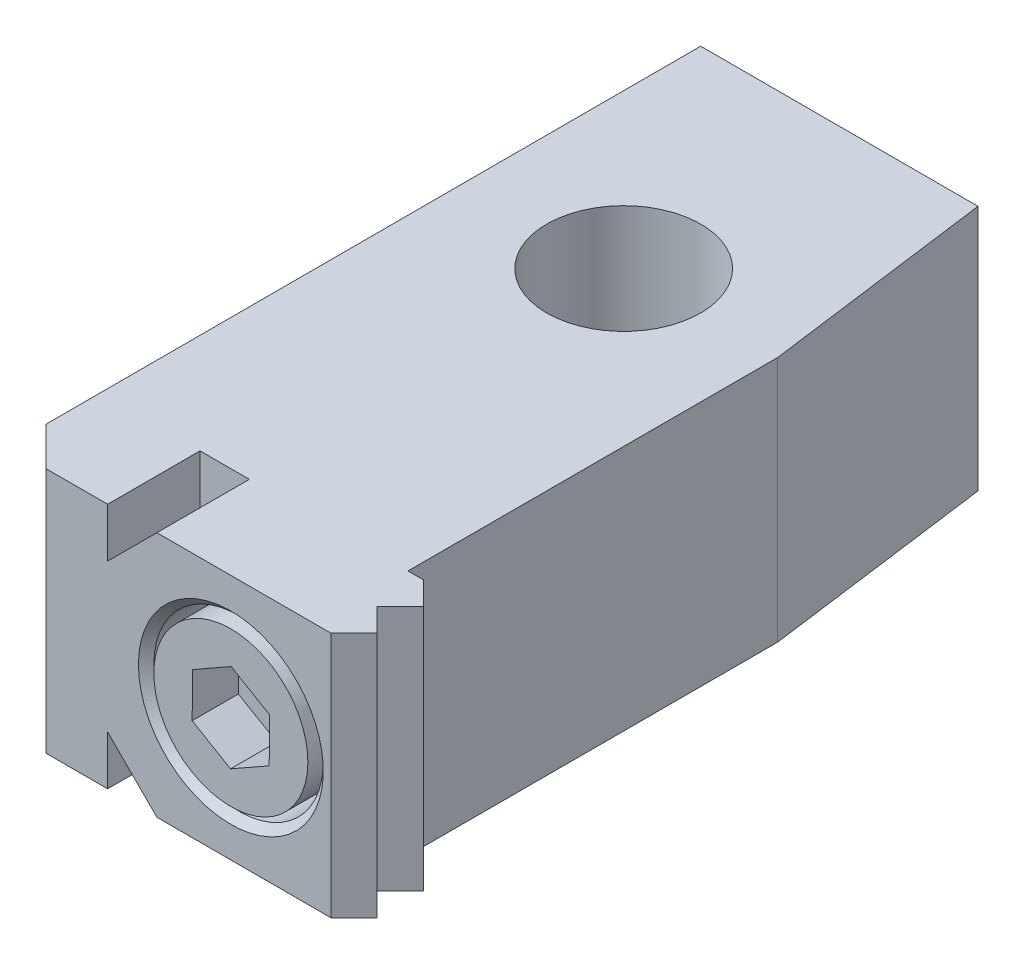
ISO-10303-21;
HEADER;
FILE_DESCRIPTION(('STEP AP214'),'2;1');
FILE_NAME('part.step','',(''),(''),'','','');
FILE_SCHEMA(('AUTOMOTIVE_DESIGN { 1 0 10303 214 1 1 1 1 }'));
ENDSEC;
DATA;
#1=APPLICATION_CONTEXT('core data for automotive mechanical design processes');
#2=APPLICATION_PROTOCOL_DEFINITION('international standard','automotive_design',2000,#1);
#3=PRODUCT_CONTEXT('',#1,'mechanical');
#4=PRODUCT('Part','Part','',(#3));
#5=PRODUCT_RELATED_PRODUCT_CATEGORY('part','',(#4));
#6=PRODUCT_DEFINITION_FORMATION('','',#4);
#7=PRODUCT_DEFINITION_CONTEXT('part definition',#1,'design');
#8=PRODUCT_DEFINITION('design','',#6,#7);
#9=PRODUCT_DEFINITION_SHAPE('','',#8);
#10=(LENGTH_UNIT() NAMED_UNIT(*) SI_UNIT(.MILLI.,.METRE.));
#11=(NAMED_UNIT(*) PLANE_ANGLE_UNIT() SI_UNIT($,.RADIAN.));
#12=(NAMED_UNIT(*) SI_UNIT($,.STERADIAN.) SOLID_ANGLE_UNIT());
#13=UNCERTAINTY_MEASURE_WITH_UNIT(LENGTH_MEASURE(1.E-05),#10,'distance_accuracy_value','');
#14=(GEOMETRIC_REPRESENTATION_CONTEXT(3) GLOBAL_UNCERTAINTY_ASSIGNED_CONTEXT((#13)) GLOBAL_UNIT_ASSIGNED_CONTEXT((#10,
#11,#12)) REPRESENTATION_CONTEXT('',''));
#15=CARTESIAN_POINT('',(0.,0.,0.));
#16=DIRECTION('',(0.,0.,1.));
#17=DIRECTION('',(1.,0.,0.));
#18=AXIS2_PLACEMENT_3D('',#15,#16,#17);
#19=CARTESIAN_POINT('',(-1.,0.,26.));
#20=DIRECTION('',(0.,0.,-1.));
#21=DIRECTION('',(1.,0.,0.));
#22=AXIS2_PLACEMENT_3D('',#19,#20,#21);
#23=PLANE('',#22);
#24=CARTESIAN_POINT('',(4.5,0.,26.));
#25=DIRECTION('',(0.,0.,1.));
#26=DIRECTION('',(-1.,0.,0.));
#27=AXIS2_PLACEMENT_3D('',#24,#25,#26);
#28=CIRCLE('',#27,5.5);
#29=CARTESIAN_POINT('',(-1.,0.,26.));
#30=VERTEX_POINT('',#29);
#31=EDGE_CURVE('E197',#30,#30,#28,.T.);
#32=ORIENTED_EDGE('',*,*,#31,.T.);
#33=EDGE_LOOP('',(#32));
#34=FACE_BOUND('',#33,.T.);
#35=CARTESIAN_POINT('',(4.5,0.,26.));
#36=DIRECTION('',(0.,0.,-1.));
#37=DIRECTION('',(-0.999972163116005,0.00746143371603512,0.));
#38=AXIS2_PLACEMENT_3D('',#35,#36,#37);
#39=CIRCLE('',#38,5.);
#40=CARTESIAN_POINT('',(-0.499860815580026,0.0373071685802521,26.));
#41=VERTEX_POINT('',#40);
#42=EDGE_CURVE('E682',#41,#41,#39,.T.);
#43=ORIENTED_EDGE('',*,*,#42,.T.);
#44=EDGE_LOOP('',(#43));
#45=FACE_BOUND('',#44,.T.);
#46=ADVANCED_FACE('F15',(#34,#45),#23,.F.);
#47=CARTESIAN_POINT('',(4.5,0.,30.));
#48=DIRECTION('',(0.,0.,1.));
#49=DIRECTION('',(-1.,0.,0.));
#50=AXIS2_PLACEMENT_3D('',#47,#48,#49);
#51=CYLINDRICAL_SURFACE('',#50,5.5);
#52=ORIENTED_EDGE('',*,*,#31,.F.);
#53=EDGE_LOOP('',(#52));
#54=FACE_BOUND('',#53,.T.);
#55=CARTESIAN_POINT('',(4.5,0.,29.4999998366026));
#56=DIRECTION('',(0.,0.,1.));
#57=DIRECTION('',(-1.,0.,0.));
#58=AXIS2_PLACEMENT_3D('',#55,#56,#57);
#59=CIRCLE('',#58,5.5);
#60=CARTESIAN_POINT('',(-1.,0.,29.4999998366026));
#61=VERTEX_POINT('',#60);
#62=EDGE_CURVE('E203',#61,#61,#59,.T.);
#63=ORIENTED_EDGE('',*,*,#62,.T.);
#64=EDGE_LOOP('',(#63));
#65=FACE_BOUND('',#64,.T.);
#66=ADVANCED_FACE('F660',(#54,#65),#51,.F.);
#67=CARTESIAN_POINT('',(4.5,0.,30.));
#68=DIRECTION('',(0.,0.,1.));
#69=DIRECTION('',(-1.,0.,0.));
#70=AXIS2_PLACEMENT_3D('',#67,#68,#69);
#71=CONICAL_SURFACE('',#70,6.,0.785398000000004);
#72=ORIENTED_EDGE('',*,*,#62,.F.);
#73=EDGE_LOOP('',(#72));
#74=FACE_BOUND('',#73,.T.);
#75=CARTESIAN_POINT('',(4.5,0.,30.));
#76=DIRECTION('',(0.,0.,1.));
#77=DIRECTION('',(-1.,0.,0.));
#78=AXIS2_PLACEMENT_3D('',#75,#76,#77);
#79=CIRCLE('',#78,6.);
#80=CARTESIAN_POINT('',(-1.5,0.,30.));
#81=VERTEX_POINT('',#80);
#82=EDGE_CURVE('E206',#81,#81,#79,.T.);
#83=ORIENTED_EDGE('',*,*,#82,.T.);
#84=EDGE_LOOP('',(#83));
#85=FACE_BOUND('',#84,.T.);
#86=ADVANCED_FACE('F650',(#74,#85),#71,.F.);
#87=CARTESIAN_POINT('',(12.5,-8.,30.));
#88=DIRECTION('',(0.,0.,1.));
#89=DIRECTION('',(-1.,0.,0.));
#90=AXIS2_PLACEMENT_3D('',#87,#88,#89);
#91=PLANE('',#90);
#92=ORIENTED_EDGE('',*,*,#82,.F.);
#93=EDGE_LOOP('',(#92));
#94=FACE_BOUND('',#93,.T.);
#95=DIRECTION('',(0.,1.,0.));
#96=VECTOR('',#95,1.);
#97=CARTESIAN_POINT('',(11.,-8.,30.));
#98=LINE('',#97,#96);
#99=CARTESIAN_POINT('',(11.,-8.,30.));
#100=VERTEX_POINT('',#99);
#101=CARTESIAN_POINT('',(11.,8.,30.));
#102=VERTEX_POINT('',#101);
#103=EDGE_CURVE('E232',#100,#102,#98,.T.);
#104=ORIENTED_EDGE('',*,*,#103,.T.);
#105=DIRECTION('',(-1.,0.,0.));
#106=VECTOR('',#105,1.);
#107=CARTESIAN_POINT('',(12.5,8.,30.));
#108=LINE('',#107,#106);
#109=CARTESIAN_POINT('',(-0.3,8.,30.));
#110=VERTEX_POINT('',#109);
#111=EDGE_CURVE('E252',#102,#110,#108,.T.);
#112=ORIENTED_EDGE('',*,*,#111,.T.);
#113=DIRECTION('',(-0.707106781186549,-0.707106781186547,0.));
#114=VECTOR('',#113,1.);
#115=CARTESIAN_POINT('',(-3.5,4.8,30.));
#116=LINE('',#115,#114);
#117=CARTESIAN_POINT('',(-3.5,4.8,30.));
#118=VERTEX_POINT('',#117);
#119=EDGE_CURVE('E254',#110,#118,#116,.T.);
#120=ORIENTED_EDGE('',*,*,#119,.T.);
#121=DIRECTION('',(0.,-1.,0.));
#122=VECTOR('',#121,1.);
#123=CARTESIAN_POINT('',(-3.5,-8.,30.));
#124=LINE('',#123,#122);
#125=CARTESIAN_POINT('',(-3.5,8.,30.));
#126=VERTEX_POINT('',#125);
#127=EDGE_CURVE('E283',#126,#118,#124,.T.);
#128=ORIENTED_EDGE('',*,*,#127,.F.);
#129=DIRECTION('',(-1.,0.,0.));
#130=VECTOR('',#129,1.);
#131=CARTESIAN_POINT('',(10.,8.,30.));
#132=LINE('',#131,#130);
#133=CARTESIAN_POINT('',(-7.5,8.,30.));
#134=VERTEX_POINT('',#133);
#135=EDGE_CURVE('E311',#126,#134,#132,.T.);
#136=ORIENTED_EDGE('',*,*,#135,.T.);
#137=DIRECTION('',(0.,-1.,0.));
#138=VECTOR('',#137,1.);
#139=CARTESIAN_POINT('',(-7.5,-8.,30.));
#140=LINE('',#139,#138);
#141=CARTESIAN_POINT('',(-7.5,-8.,30.));
#142=VERTEX_POINT('',#141);
#143=EDGE_CURVE('E143',#134,#142,#140,.T.);
#144=ORIENTED_EDGE('',*,*,#143,.T.);
#145=DIRECTION('',(-1.,0.,0.));
#146=VECTOR('',#145,1.);
#147=CARTESIAN_POINT('',(10.,-8.,30.));
#148=LINE('',#147,#146);
#149=CARTESIAN_POINT('',(-3.5,-8.,30.));
#150=VERTEX_POINT('',#149);
#151=EDGE_CURVE('E182',#150,#142,#148,.T.);
#152=ORIENTED_EDGE('',*,*,#151,.F.);
#153=CARTESIAN_POINT('',(-3.5,-4.8,30.));
#154=VERTEX_POINT('',#153);
#155=EDGE_CURVE('E170',#154,#150,#124,.T.);
#156=ORIENTED_EDGE('',*,*,#155,.F.);
#157=DIRECTION('',(0.707106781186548,-0.707106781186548,0.));
#158=VECTOR('',#157,1.);
#159=CARTESIAN_POINT('',(-0.3,-8.,30.));
#160=LINE('',#159,#158);
#161=CARTESIAN_POINT('',(-0.3,-8.,30.));
#162=VERTEX_POINT('',#161);
#163=EDGE_CURVE('E257',#154,#162,#160,.T.);
#164=ORIENTED_EDGE('',*,*,#163,.T.);
#165=DIRECTION('',(1.,0.,0.));
#166=VECTOR('',#165,1.);
#167=CARTESIAN_POINT('',(12.5,-8.,30.));
#168=LINE('',#167,#166);
#169=EDGE_CURVE('E259',#162,#100,#168,.T.);
#170=ORIENTED_EDGE('',*,*,#169,.T.);
#171=EDGE_LOOP('',(#104,#112,#120,#128,#136,#144,#152,#156,#164,#170));
#172=FACE_BOUND('',#171,.T.);
#173=ADVANCED_FACE('F355',(#94,#172),#91,.T.);
#174=CARTESIAN_POINT('',(12.5,-8.,28.5));
#175=DIRECTION('',(-0.70710678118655,0.,-0.707106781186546));
#176=DIRECTION('',(0.707106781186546,0.,-0.70710678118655));
#177=AXIS2_PLACEMENT_3D('',#174,#175,#176);
#178=PLANE('',#177);
#179=DIRECTION('',(-0.707106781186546,0.,0.70710678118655));
#180=VECTOR('',#179,1.);
#181=CARTESIAN_POINT('',(12.5,8.,28.5));
#182=LINE('',#181,#180);
#183=CARTESIAN_POINT('',(12.5,8.,28.5));
#184=VERTEX_POINT('',#183);
#185=EDGE_CURVE('E218',#184,#102,#182,.T.);
#186=ORIENTED_EDGE('',*,*,#185,.T.);
#187=ORIENTED_EDGE('',*,*,#103,.F.);
#188=DIRECTION('',(-0.707106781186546,0.,0.70710678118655));
#189=VECTOR('',#188,1.);
#190=CARTESIAN_POINT('',(12.5,-8.,28.5));
#191=LINE('',#190,#189);
#192=CARTESIAN_POINT('',(12.5,-8.,28.5));
#193=VERTEX_POINT('',#192);
#194=EDGE_CURVE('E228',#193,#100,#191,.T.);
#195=ORIENTED_EDGE('',*,*,#194,.F.);
#196=DIRECTION('',(0.,1.,0.));
#197=VECTOR('',#196,1.);
#198=CARTESIAN_POINT('',(12.5,-8.,28.5));
#199=LINE('',#198,#197);
#200=EDGE_CURVE('E236',#193,#184,#199,.T.);
#201=ORIENTED_EDGE('',*,*,#200,.T.);
#202=EDGE_LOOP('',(#186,#187,#195,#201));
#203=FACE_BOUND('',#202,.T.);
#204=ADVANCED_FACE('F354',(#203),#178,.F.);
#205=CARTESIAN_POINT('',(12.5,8.,30.));
#206=DIRECTION('',(0.,-1.,0.));
#207=DIRECTION('',(0.,0.,1.));
#208=AXIS2_PLACEMENT_3D('',#205,#206,#207);
#209=PLANE('',#208);
#210=ORIENTED_EDGE('',*,*,#111,.F.);
#211=ORIENTED_EDGE('',*,*,#185,.F.);
#212=DIRECTION('',(0.707106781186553,0.,0.707106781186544));
#213=VECTOR('',#212,1.);
#214=CARTESIAN_POINT('',(11.,8.,27.));
#215=LINE('',#214,#213);
#216=CARTESIAN_POINT('',(11.,8.,27.));
#217=VERTEX_POINT('',#216);
#218=EDGE_CURVE('E215',#217,#184,#215,.T.);
#219=ORIENTED_EDGE('',*,*,#218,.F.);
#220=DIRECTION('',(-0.707106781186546,0.,0.70710678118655));
#221=VECTOR('',#220,1.);
#222=CARTESIAN_POINT('',(12.5,8.,25.5));
#223=LINE('',#222,#221);
#224=CARTESIAN_POINT('',(12.5,8.,25.5));
#225=VERTEX_POINT('',#224);
#226=EDGE_CURVE('E212',#225,#217,#223,.T.);
#227=ORIENTED_EDGE('',*,*,#226,.F.);
#228=DIRECTION('',(0.707106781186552,0.,0.707106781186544));
#229=VECTOR('',#228,1.);
#230=CARTESIAN_POINT('',(11.,8.,24.));
#231=LINE('',#230,#229);
#232=CARTESIAN_POINT('',(11.,8.,24.));
#233=VERTEX_POINT('',#232);
#234=EDGE_CURVE('E209',#233,#225,#231,.T.);
#235=ORIENTED_EDGE('',*,*,#234,.F.);
#236=DIRECTION('',(-1.,0.,0.));
#237=VECTOR('',#236,1.);
#238=CARTESIAN_POINT('',(12.5,8.,24.));
#239=LINE('',#238,#237);
#240=CARTESIAN_POINT('',(10.,8.,24.));
#241=VERTEX_POINT('',#240);
#242=EDGE_CURVE('E235',#233,#241,#239,.T.);
#243=ORIENTED_EDGE('',*,*,#242,.T.);
#244=DIRECTION('',(0.,0.,1.));
#245=VECTOR('',#244,1.);
#246=CARTESIAN_POINT('',(10.,8.,-15.));
#247=LINE('',#246,#245);
#248=CARTESIAN_POINT('',(10.,8.,0.));
#249=VERTEX_POINT('',#248);
#250=EDGE_CURVE('E308',#249,#241,#247,.T.);
#251=ORIENTED_EDGE('',*,*,#250,.F.);
#252=DIRECTION('',(-0.132163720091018,0.,-0.991227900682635));
#253=VECTOR('',#252,1.);
#254=CARTESIAN_POINT('',(8.,8.,-15.));
#255=LINE('',#254,#253);
#256=CARTESIAN_POINT('',(8.,8.,-15.));
#257=VERTEX_POINT('',#256);
#258=EDGE_CURVE('E159',#249,#257,#255,.T.);
#259=ORIENTED_EDGE('',*,*,#258,.T.);
#260=DIRECTION('',(1.,0.,0.));
#261=VECTOR('',#260,1.);
#262=CARTESIAN_POINT('',(10.,8.,-15.));
#263=LINE('',#262,#261);
#264=CARTESIAN_POINT('',(-10.,8.,-15.));
#265=VERTEX_POINT('',#264);
#266=EDGE_CURVE('E169',#265,#257,#263,.T.);
#267=ORIENTED_EDGE('',*,*,#266,.F.);
#268=DIRECTION('',(0.,0.,-1.));
#269=VECTOR('',#268,1.);
#270=CARTESIAN_POINT('',(-10.,8.,-15.));
#271=LINE('',#270,#269);
#272=CARTESIAN_POINT('',(-10.,8.,27.5));
#273=VERTEX_POINT('',#272);
#274=EDGE_CURVE('E313',#273,#265,#271,.T.);
#275=ORIENTED_EDGE('',*,*,#274,.F.);
#276=DIRECTION('',(-0.707106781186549,0.,-0.707106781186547));
#277=VECTOR('',#276,1.);
#278=CARTESIAN_POINT('',(-10.,8.,27.5));
#279=LINE('',#278,#277);
#280=EDGE_CURVE('E188',#273,#134,#279,.F.);
#281=ORIENTED_EDGE('',*,*,#280,.T.);
#282=ORIENTED_EDGE('',*,*,#135,.F.);
#283=DIRECTION('',(0.,0.,1.));
#284=VECTOR('',#283,1.);
#285=CARTESIAN_POINT('',(-3.5,8.,24.));
#286=LINE('',#285,#284);
#287=CARTESIAN_POINT('',(-3.5,8.,24.));
#288=VERTEX_POINT('',#287);
#289=EDGE_CURVE('E297',#288,#126,#286,.T.);
#290=ORIENTED_EDGE('',*,*,#289,.F.);
#291=DIRECTION('',(-1.,0.,0.));
#292=VECTOR('',#291,1.);
#293=CARTESIAN_POINT('',(10.,8.,24.));
#294=LINE('',#293,#292);
#295=CARTESIAN_POINT('',(-0.3,8.,24.));
#296=VERTEX_POINT('',#295);
#297=EDGE_CURVE('E286',#296,#288,#294,.T.);
#298=ORIENTED_EDGE('',*,*,#297,.F.);
#299=DIRECTION('',(0.,0.,-1.));
#300=VECTOR('',#299,1.);
#301=CARTESIAN_POINT('',(-0.3,8.,30.));
#302=LINE('',#301,#300);
#303=EDGE_CURVE('E269',#110,#296,#302,.T.);
#304=ORIENTED_EDGE('',*,*,#303,.F.);
#305=EDGE_LOOP('',(#210,#211,#219,#227,#235,#243,#251,#259,#267,#275,#281,#282,#290,#298,#304));
#306=FACE_BOUND('',#305,.T.);
#307=CARTESIAN_POINT('',(0.,8.,0.));
#308=DIRECTION('',(0.,-1.,0.));
#309=DIRECTION('',(0.,0.,1.));
#310=AXIS2_PLACEMENT_3D('',#307,#308,#309);
#311=CIRCLE('',#310,5.);
#312=CARTESIAN_POINT('',(0.,8.,5.));
#313=VERTEX_POINT('',#312);
#314=EDGE_CURVE('E301',#313,#313,#311,.T.);
#315=ORIENTED_EDGE('',*,*,#314,.T.);
#316=EDGE_LOOP('',(#315));
#317=FACE_BOUND('',#316,.T.);
#318=ADVANCED_FACE('F328',(#306,#317),#209,.F.);
#319=CARTESIAN_POINT('',(-3.5,4.8,30.));
#320=DIRECTION('',(0.707106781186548,-0.707106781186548,0.));
#321=DIRECTION('',(0.707106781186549,0.707106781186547,0.));
#322=AXIS2_PLACEMENT_3D('',#319,#320,#321);
#323=PLANE('',#322);
#324=DIRECTION('',(-0.707106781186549,-0.707106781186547,0.));
#325=VECTOR('',#324,1.);
#326=CARTESIAN_POINT('',(-3.5,4.8,24.));
#327=LINE('',#326,#325);
#328=CARTESIAN_POINT('',(-3.5,4.8,24.));
#329=VERTEX_POINT('',#328);
#330=EDGE_CURVE('E245',#296,#329,#327,.T.);
#331=ORIENTED_EDGE('',*,*,#330,.T.);
#332=DIRECTION('',(0.,0.,-1.));
#333=VECTOR('',#332,1.);
#334=CARTESIAN_POINT('',(-3.5,4.8,30.));
#335=LINE('',#334,#333);
#336=EDGE_CURVE('E267',#118,#329,#335,.T.);
#337=ORIENTED_EDGE('',*,*,#336,.F.);
#338=ORIENTED_EDGE('',*,*,#119,.F.);
#339=ORIENTED_EDGE('',*,*,#303,.T.);
#340=EDGE_LOOP('',(#331,#337,#338,#339));
#341=FACE_BOUND('',#340,.T.);
#342=ADVANCED_FACE('F361',(#341),#323,.F.);
#343=CARTESIAN_POINT('',(-0.3,-8.,30.));
#344=DIRECTION('',(0.707106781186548,0.707106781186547,0.));
#345=DIRECTION('',(-0.707106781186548,0.707106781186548,0.));
#346=AXIS2_PLACEMENT_3D('',#343,#344,#345);
#347=PLANE('',#346);
#348=DIRECTION('',(0.707106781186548,-0.707106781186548,0.));
#349=VECTOR('',#348,1.);
#350=CARTESIAN_POINT('',(-0.3,-8.,24.));
#351=LINE('',#350,#349);
#352=CARTESIAN_POINT('',(-3.5,-4.8,24.));
#353=VERTEX_POINT('',#352);
#354=CARTESIAN_POINT('',(-0.3,-8.,24.));
#355=VERTEX_POINT('',#354);
#356=EDGE_CURVE('E248',#353,#355,#351,.T.);
#357=ORIENTED_EDGE('',*,*,#356,.T.);
#358=DIRECTION('',(0.,0.,-1.));
#359=VECTOR('',#358,1.);
#360=CARTESIAN_POINT('',(-0.3,-8.,30.));
#361=LINE('',#360,#359);
#362=EDGE_CURVE('E262',#162,#355,#361,.T.);
#363=ORIENTED_EDGE('',*,*,#362,.F.);
#364=ORIENTED_EDGE('',*,*,#163,.F.);
#365=DIRECTION('',(0.,0.,-1.));
#366=VECTOR('',#365,1.);
#367=CARTESIAN_POINT('',(-3.5,-4.8,30.));
#368=LINE('',#367,#366);
#369=EDGE_CURVE('E265',#154,#353,#368,.T.);
#370=ORIENTED_EDGE('',*,*,#369,.T.);
#371=EDGE_LOOP('',(#357,#363,#364,#370));
#372=FACE_BOUND('',#371,.T.);
#373=ADVANCED_FACE('F381',(#372),#347,.F.);
#374=CARTESIAN_POINT('',(12.5,-8.,30.));
#375=DIRECTION('',(0.,1.,0.));
#376=DIRECTION('',(-1.,0.,0.));
#377=AXIS2_PLACEMENT_3D('',#374,#375,#376);
#378=PLANE('',#377);
#379=DIRECTION('',(0.707106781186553,0.,0.707106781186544));
#380=VECTOR('',#379,1.);
#381=CARTESIAN_POINT('',(11.,-8.,27.));
#382=LINE('',#381,#380);
#383=CARTESIAN_POINT('',(11.,-8.,27.));
#384=VERTEX_POINT('',#383);
#385=EDGE_CURVE('E226',#384,#193,#382,.T.);
#386=ORIENTED_EDGE('',*,*,#385,.T.);
#387=ORIENTED_EDGE('',*,*,#194,.T.);
#388=ORIENTED_EDGE('',*,*,#169,.F.);
#389=ORIENTED_EDGE('',*,*,#362,.T.);
#390=DIRECTION('',(1.,0.,0.));
#391=VECTOR('',#390,1.);
#392=CARTESIAN_POINT('',(10.,-8.,24.));
#393=LINE('',#392,#391);
#394=CARTESIAN_POINT('',(-3.5,-8.,24.));
#395=VERTEX_POINT('',#394);
#396=EDGE_CURVE('E294',#395,#355,#393,.T.);
#397=ORIENTED_EDGE('',*,*,#396,.F.);
#398=DIRECTION('',(0.,0.,1.));
#399=VECTOR('',#398,1.);
#400=CARTESIAN_POINT('',(-3.5,-8.,24.));
#401=LINE('',#400,#399);
#402=EDGE_CURVE('E298',#395,#150,#401,.T.);
#403=ORIENTED_EDGE('',*,*,#402,.T.);
#404=ORIENTED_EDGE('',*,*,#151,.T.);
#405=DIRECTION('',(0.707106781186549,0.,0.707106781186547));
#406=VECTOR('',#405,1.);
#407=CARTESIAN_POINT('',(1.25,-8.,38.75));
#408=LINE('',#407,#406);
#409=CARTESIAN_POINT('',(-10.,-8.,27.5));
#410=VERTEX_POINT('',#409);
#411=EDGE_CURVE('E19',#142,#410,#408,.F.);
#412=ORIENTED_EDGE('',*,*,#411,.T.);
#413=DIRECTION('',(0.,0.,-1.));
#414=VECTOR('',#413,1.);
#415=CARTESIAN_POINT('',(-10.,-8.,-15.));
#416=LINE('',#415,#414);
#417=CARTESIAN_POINT('',(-10.,-8.,-15.));
#418=VERTEX_POINT('',#417);
#419=EDGE_CURVE('E176',#410,#418,#416,.T.);
#420=ORIENTED_EDGE('',*,*,#419,.T.);
#421=DIRECTION('',(1.,0.,0.));
#422=VECTOR('',#421,1.);
#423=CARTESIAN_POINT('',(10.,-8.,-15.));
#424=LINE('',#423,#422);
#425=CARTESIAN_POINT('',(8.,-8.,-15.));
#426=VERTEX_POINT('',#425);
#427=EDGE_CURVE('E167',#418,#426,#424,.T.);
#428=ORIENTED_EDGE('',*,*,#427,.T.);
#429=DIRECTION('',(-0.132163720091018,0.,-0.991227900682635));
#430=VECTOR('',#429,1.);
#431=CARTESIAN_POINT('',(8.,-8.,-15.));
#432=LINE('',#431,#430);
#433=CARTESIAN_POINT('',(10.,-8.,0.));
#434=VERTEX_POINT('',#433);
#435=EDGE_CURVE('E148',#434,#426,#432,.T.);
#436=ORIENTED_EDGE('',*,*,#435,.F.);
#437=DIRECTION('',(0.,0.,1.));
#438=VECTOR('',#437,1.);
#439=CARTESIAN_POINT('',(10.,-8.,-15.));
#440=LINE('',#439,#438);
#441=CARTESIAN_POINT('',(10.,-8.,24.));
#442=VERTEX_POINT('',#441);
#443=EDGE_CURVE('E316',#434,#442,#440,.T.);
#444=ORIENTED_EDGE('',*,*,#443,.T.);
#445=DIRECTION('',(1.,0.,0.));
#446=VECTOR('',#445,1.);
#447=CARTESIAN_POINT('',(12.5,-8.,24.));
#448=LINE('',#447,#446);
#449=CARTESIAN_POINT('',(11.,-8.,24.));
#450=VERTEX_POINT('',#449);
#451=EDGE_CURVE('E250',#442,#450,#448,.T.);
#452=ORIENTED_EDGE('',*,*,#451,.T.);
#453=DIRECTION('',(0.707106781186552,0.,0.707106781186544));
#454=VECTOR('',#453,1.);
#455=CARTESIAN_POINT('',(11.,-8.,24.));
#456=LINE('',#455,#454);
#457=CARTESIAN_POINT('',(12.5,-8.,25.5));
#458=VERTEX_POINT('',#457);
#459=EDGE_CURVE('E220',#450,#458,#456,.T.);
#460=ORIENTED_EDGE('',*,*,#459,.T.);
#461=DIRECTION('',(-0.707106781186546,0.,0.70710678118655));
#462=VECTOR('',#461,1.);
#463=CARTESIAN_POINT('',(12.5,-8.,25.5));
#464=LINE('',#463,#462);
#465=EDGE_CURVE('E223',#458,#384,#464,.T.);
#466=ORIENTED_EDGE('',*,*,#465,.T.);
#467=EDGE_LOOP('',(#386,#387,#388,#389,#397,#403,#404,#412,#420,#428,#436,#444,#452,#460,#466));
#468=FACE_BOUND('',#467,.T.);
#469=CARTESIAN_POINT('',(0.,-8.,0.));
#470=DIRECTION('',(0.,-1.,0.));
#471=DIRECTION('',(0.,0.,1.));
#472=AXIS2_PLACEMENT_3D('',#469,#470,#471);
#473=CIRCLE('',#472,5.);
#474=CARTESIAN_POINT('',(0.,-8.,5.));
#475=VERTEX_POINT('',#474);
#476=EDGE_CURVE('E305',#475,#475,#473,.T.);
#477=ORIENTED_EDGE('',*,*,#476,.F.);
#478=EDGE_LOOP('',(#477));
#479=FACE_BOUND('',#478,.T.);
#480=ADVANCED_FACE('F173',(#468,#479),#378,.F.);
#481=CARTESIAN_POINT('',(11.,-8.,27.));
#482=DIRECTION('',(-0.707106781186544,0.,0.707106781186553));
#483=DIRECTION('',(-0.707106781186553,0.,-0.707106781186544));
#484=AXIS2_PLACEMENT_3D('',#481,#482,#483);
#485=PLANE('',#484);
#486=ORIENTED_EDGE('',*,*,#218,.T.);
#487=ORIENTED_EDGE('',*,*,#200,.F.);
#488=ORIENTED_EDGE('',*,*,#385,.F.);
#489=DIRECTION('',(0.,1.,0.));
#490=VECTOR('',#489,1.);
#491=CARTESIAN_POINT('',(11.,-8.,27.));
#492=LINE('',#491,#490);
#493=EDGE_CURVE('E238',#384,#217,#492,.T.);
#494=ORIENTED_EDGE('',*,*,#493,.T.);
#495=EDGE_LOOP('',(#486,#487,#488,#494));
#496=FACE_BOUND('',#495,.T.);
#497=ADVANCED_FACE('F352',(#496),#485,.F.);
#498=CARTESIAN_POINT('',(12.5,-8.,25.5));
#499=DIRECTION('',(-0.70710678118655,0.,-0.707106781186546));
#500=DIRECTION('',(0.707106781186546,0.,-0.70710678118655));
#501=AXIS2_PLACEMENT_3D('',#498,#499,#500);
#502=PLANE('',#501);
#503=ORIENTED_EDGE('',*,*,#226,.T.);
#504=ORIENTED_EDGE('',*,*,#493,.F.);
#505=ORIENTED_EDGE('',*,*,#465,.F.);
#506=DIRECTION('',(0.,1.,0.));
#507=VECTOR('',#506,1.);
#508=CARTESIAN_POINT('',(12.5,-8.,25.5));
#509=LINE('',#508,#507);
#510=EDGE_CURVE('E240',#458,#225,#509,.T.);
#511=ORIENTED_EDGE('',*,*,#510,.T.);
#512=EDGE_LOOP('',(#503,#504,#505,#511));
#513=FACE_BOUND('',#512,.T.);
#514=ADVANCED_FACE('F346',(#513),#502,.F.);
#515=CARTESIAN_POINT('',(11.,-8.,24.));
#516=DIRECTION('',(-0.707106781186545,0.,0.707106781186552));
#517=DIRECTION('',(-0.707106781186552,0.,-0.707106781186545));
#518=AXIS2_PLACEMENT_3D('',#515,#516,#517);
#519=PLANE('',#518);
#520=ORIENTED_EDGE('',*,*,#234,.T.);
#521=ORIENTED_EDGE('',*,*,#510,.F.);
#522=ORIENTED_EDGE('',*,*,#459,.F.);
#523=DIRECTION('',(0.,1.,0.));
#524=VECTOR('',#523,1.);
#525=CARTESIAN_POINT('',(11.,-8.,24.));
#526=LINE('',#525,#524);
#527=EDGE_CURVE('E231',#450,#233,#526,.T.);
#528=ORIENTED_EDGE('',*,*,#527,.T.);
#529=EDGE_LOOP('',(#520,#521,#522,#528));
#530=FACE_BOUND('',#529,.T.);
#531=ADVANCED_FACE('F341',(#530),#519,.F.);
#532=CARTESIAN_POINT('',(12.5,-8.,24.));
#533=DIRECTION('',(0.,0.,1.));
#534=DIRECTION('',(-1.,0.,0.));
#535=AXIS2_PLACEMENT_3D('',#532,#533,#534);
#536=PLANE('',#535);
#537=ORIENTED_EDGE('',*,*,#451,.F.);
#538=DIRECTION('',(0.,1.,0.));
#539=VECTOR('',#538,1.);
#540=CARTESIAN_POINT('',(10.,-8.,24.));
#541=LINE('',#540,#539);
#542=EDGE_CURVE('E272',#442,#241,#541,.T.);
#543=ORIENTED_EDGE('',*,*,#542,.T.);
#544=ORIENTED_EDGE('',*,*,#242,.F.);
#545=ORIENTED_EDGE('',*,*,#527,.F.);
#546=EDGE_LOOP('',(#537,#543,#544,#545));
#547=FACE_BOUND('',#546,.T.);
#548=ADVANCED_FACE('F337',(#547),#536,.F.);
#549=CARTESIAN_POINT('',(10.,8.,24.));
#550=DIRECTION('',(0.,0.,1.));
#551=DIRECTION('',(-1.,0.,0.));
#552=AXIS2_PLACEMENT_3D('',#549,#550,#551);
#553=PLANE('',#552);
#554=ORIENTED_EDGE('',*,*,#330,.F.);
#555=ORIENTED_EDGE('',*,*,#297,.T.);
#556=DIRECTION('',(0.,-1.,0.));
#557=VECTOR('',#556,1.);
#558=CARTESIAN_POINT('',(-3.5,-8.,24.));
#559=LINE('',#558,#557);
#560=EDGE_CURVE('E291',#288,#329,#559,.T.);
#561=ORIENTED_EDGE('',*,*,#560,.T.);
#562=EDGE_LOOP('',(#554,#555,#561));
#563=FACE_BOUND('',#562,.T.);
#564=ADVANCED_FACE('F367',(#563),#553,.T.);
#565=CARTESIAN_POINT('',(-3.5,-8.,24.));
#566=DIRECTION('',(-1.,0.,0.));
#567=DIRECTION('',(0.,-1.,0.));
#568=AXIS2_PLACEMENT_3D('',#565,#566,#567);
#569=PLANE('',#568);
#570=ORIENTED_EDGE('',*,*,#127,.T.);
#571=ORIENTED_EDGE('',*,*,#336,.T.);
#572=ORIENTED_EDGE('',*,*,#560,.F.);
#573=ORIENTED_EDGE('',*,*,#289,.T.);
#574=EDGE_LOOP('',(#570,#571,#572,#573));
#575=FACE_BOUND('',#574,.T.);
#576=ADVANCED_FACE('F365',(#575),#569,.F.);
#577=CARTESIAN_POINT('',(-10.,-8.,27.5));
#578=DIRECTION('',(0.707106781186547,0.,-0.707106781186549));
#579=DIRECTION('',(0.707106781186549,0.,0.707106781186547));
#580=AXIS2_PLACEMENT_3D('',#577,#578,#579);
#581=PLANE('',#580);
#582=ORIENTED_EDGE('',*,*,#411,.F.);
#583=ORIENTED_EDGE('',*,*,#143,.F.);
#584=ORIENTED_EDGE('',*,*,#280,.F.);
#585=DIRECTION('',(0.,1.,0.));
#586=VECTOR('',#585,1.);
#587=CARTESIAN_POINT('',(-10.,-8.,27.5));
#588=LINE('',#587,#586);
#589=EDGE_CURVE('E180',#410,#273,#588,.T.);
#590=ORIENTED_EDGE('',*,*,#589,.F.);
#591=EDGE_LOOP('',(#582,#583,#584,#590));
#592=FACE_BOUND('',#591,.T.);
#593=ADVANCED_FACE('F322',(#592),#581,.F.);
#594=EDGE_CURVE('E290',#353,#395,#559,.T.);
#595=ORIENTED_EDGE('',*,*,#594,.F.);
#596=ORIENTED_EDGE('',*,*,#369,.F.);
#597=ORIENTED_EDGE('',*,*,#155,.T.);
#598=ORIENTED_EDGE('',*,*,#402,.F.);
#599=EDGE_LOOP('',(#595,#596,#597,#598));
#600=FACE_BOUND('',#599,.T.);
#601=ADVANCED_FACE('F379',(#600),#569,.F.);
#602=ORIENTED_EDGE('',*,*,#356,.F.);
#603=ORIENTED_EDGE('',*,*,#594,.T.);
#604=ORIENTED_EDGE('',*,*,#396,.T.);
#605=EDGE_LOOP('',(#602,#603,#604));
#606=FACE_BOUND('',#605,.T.);
#607=ADVANCED_FACE('F371',(#606),#553,.T.);
#608=CARTESIAN_POINT('',(10.,-8.,-15.));
#609=DIRECTION('',(-1.,0.,0.));
#610=DIRECTION('',(0.,0.,-1.));
#611=AXIS2_PLACEMENT_3D('',#608,#609,#610);
#612=PLANE('',#611);
#613=ORIENTED_EDGE('',*,*,#443,.F.);
#614=DIRECTION('',(0.,-1.,0.));
#615=VECTOR('',#614,1.);
#616=CARTESIAN_POINT('',(10.,8.,0.));
#617=LINE('',#616,#615);
#618=EDGE_CURVE('E154',#249,#434,#617,.T.);
#619=ORIENTED_EDGE('',*,*,#618,.F.);
#620=ORIENTED_EDGE('',*,*,#250,.T.);
#621=ORIENTED_EDGE('',*,*,#542,.F.);
#622=EDGE_LOOP('',(#613,#619,#620,#621));
#623=FACE_BOUND('',#622,.T.);
#624=ADVANCED_FACE('F17',(#623),#612,.F.);
#625=CARTESIAN_POINT('',(8.,8.,-15.));
#626=DIRECTION('',(-0.991227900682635,0.,0.132163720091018));
#627=DIRECTION('',(-0.132163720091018,0.,-0.991227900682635));
#628=AXIS2_PLACEMENT_3D('',#625,#626,#627);
#629=PLANE('',#628);
#630=ORIENTED_EDGE('',*,*,#435,.T.);
#631=DIRECTION('',(0.,-1.,0.));
#632=VECTOR('',#631,1.);
#633=CARTESIAN_POINT('',(8.,8.,-15.));
#634=LINE('',#633,#632);
#635=EDGE_CURVE('E151',#257,#426,#634,.T.);
#636=ORIENTED_EDGE('',*,*,#635,.F.);
#637=ORIENTED_EDGE('',*,*,#258,.F.);
#638=ORIENTED_EDGE('',*,*,#618,.T.);
#639=EDGE_LOOP('',(#630,#636,#637,#638));
#640=FACE_BOUND('',#639,.T.);
#641=ADVANCED_FACE('F150',(#640),#629,.F.);
#642=CARTESIAN_POINT('',(10.,-8.,-15.));
#643=DIRECTION('',(0.,0.,1.));
#644=DIRECTION('',(-1.,0.,0.));
#645=AXIS2_PLACEMENT_3D('',#642,#643,#644);
#646=PLANE('',#645);
#647=ORIENTED_EDGE('',*,*,#266,.T.);
#648=ORIENTED_EDGE('',*,*,#635,.T.);
#649=ORIENTED_EDGE('',*,*,#427,.F.);
#650=DIRECTION('',(0.,1.,0.));
#651=VECTOR('',#650,1.);
#652=CARTESIAN_POINT('',(-10.,-8.,-15.));
#653=LINE('',#652,#651);
#654=EDGE_CURVE('E178',#418,#265,#653,.T.);
#655=ORIENTED_EDGE('',*,*,#654,.T.);
#656=EDGE_LOOP('',(#647,#648,#649,#655));
#657=FACE_BOUND('',#656,.T.);
#658=ADVANCED_FACE('F165',(#657),#646,.F.);
#659=CARTESIAN_POINT('',(-10.,-8.,-15.));
#660=DIRECTION('',(1.,0.,0.));
#661=DIRECTION('',(0.,0.,1.));
#662=AXIS2_PLACEMENT_3D('',#659,#660,#661);
#663=PLANE('',#662);
#664=ORIENTED_EDGE('',*,*,#419,.F.);
#665=ORIENTED_EDGE('',*,*,#589,.T.);
#666=ORIENTED_EDGE('',*,*,#274,.T.);
#667=ORIENTED_EDGE('',*,*,#654,.F.);
#668=EDGE_LOOP('',(#664,#665,#666,#667));
#669=FACE_BOUND('',#668,.T.);
#670=ADVANCED_FACE('F325',(#669),#663,.F.);
#671=CARTESIAN_POINT('',(0.,-8.,0.));
#672=DIRECTION('',(0.,1.,0.));
#673=DIRECTION('',(0.,0.,-1.));
#674=AXIS2_PLACEMENT_3D('',#671,#672,#673);
#675=CYLINDRICAL_SURFACE('',#674,5.);
#676=ORIENTED_EDGE('',*,*,#476,.T.);
#677=EDGE_LOOP('',(#676));
#678=FACE_BOUND('',#677,.T.);
#679=ORIENTED_EDGE('',*,*,#314,.F.);
#680=EDGE_LOOP('',(#679));
#681=FACE_BOUND('',#680,.T.);
#682=ADVANCED_FACE('F396',(#678,#681),#675,.F.);
#683=CARTESIAN_POINT('',(4.5,0.,30.));
#684=DIRECTION('',(0.,0.,1.));
#685=DIRECTION('',(0.999972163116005,-0.00746143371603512,0.));
#686=AXIS2_PLACEMENT_3D('',#683,#684,#685);
#687=PLANE('',#686);
#688=CARTESIAN_POINT('',(4.5,0.,30.));
#689=DIRECTION('',(0.,0.,1.));
#690=DIRECTION('',(0.999972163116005,-0.00746143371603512,0.));
#691=AXIS2_PLACEMENT_3D('',#688,#689,#690);
#692=CIRCLE('',#691,5.);
#693=CARTESIAN_POINT('',(9.49986081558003,-0.0373071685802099,30.));
#694=VERTEX_POINT('',#693);
#695=EDGE_CURVE('E740',#694,#694,#692,.T.);
#696=ORIENTED_EDGE('',*,*,#695,.T.);
#697=EDGE_LOOP('',(#696));
#698=FACE_BOUND('',#697,.T.);
#699=DIRECTION('',(-0.869732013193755,-0.493524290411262,0.));
#700=VECTOR('',#699,1.);
#701=CARTESIAN_POINT('',(4.52153930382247,2.88667098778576,30.));
#702=LINE('',#701,#700);
#703=CARTESIAN_POINT('',(4.52153930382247,2.88667098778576,30.));
#704=VERTEX_POINT('',#703);
#705=CARTESIAN_POINT('',(2.01083924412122,1.46198907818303,30.));
#706=VERTEX_POINT('',#705);
#707=EDGE_CURVE('E692',#704,#706,#702,.T.);
#708=ORIENTED_EDGE('',*,*,#707,.F.);
#709=DIRECTION('',(0.86227057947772,-0.506447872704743,0.));
#710=VECTOR('',#709,1.);
#711=CARTESIAN_POINT('',(4.52153930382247,2.88667098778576,30.));
#712=LINE('',#711,#710);
#713=CARTESIAN_POINT('',(7.01070005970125,1.42468190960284,30.));
#714=VERTEX_POINT('',#713);
#715=EDGE_CURVE('E35',#704,#714,#712,.T.);
#716=ORIENTED_EDGE('',*,*,#715,.T.);
#717=DIRECTION('',(0.00746143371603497,0.999972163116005,0.));
#718=VECTOR('',#717,1.);
#719=CARTESIAN_POINT('',(6.98916075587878,-1.46198907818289,30.));
#720=LINE('',#719,#718);
#721=CARTESIAN_POINT('',(6.98916075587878,-1.46198907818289,30.));
#722=VERTEX_POINT('',#721);
#723=EDGE_CURVE('E686',#722,#714,#720,.T.);
#724=ORIENTED_EDGE('',*,*,#723,.F.);
#725=DIRECTION('',(0.869732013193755,0.493524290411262,0.));
#726=VECTOR('',#725,1.);
#727=CARTESIAN_POINT('',(4.47846069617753,-2.88667098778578,30.));
#728=LINE('',#727,#726);
#729=CARTESIAN_POINT('',(4.47846069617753,-2.88667098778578,30.));
#730=VERTEX_POINT('',#729);
#731=EDGE_CURVE('E702',#730,#722,#728,.T.);
#732=ORIENTED_EDGE('',*,*,#731,.F.);
#733=DIRECTION('',(-0.86227057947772,0.506447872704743,0.));
#734=VECTOR('',#733,1.);
#735=CARTESIAN_POINT('',(4.47846069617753,-2.88667098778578,30.));
#736=LINE('',#735,#734);
#737=CARTESIAN_POINT('',(1.98929994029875,-1.42468190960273,30.));
#738=VERTEX_POINT('',#737);
#739=EDGE_CURVE('E699',#730,#738,#736,.T.);
#740=ORIENTED_EDGE('',*,*,#739,.T.);
#741=DIRECTION('',(-0.00746143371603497,-0.999972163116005,0.));
#742=VECTOR('',#741,1.);
#743=CARTESIAN_POINT('',(2.01083924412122,1.46198907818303,30.));
#744=LINE('',#743,#742);
#745=EDGE_CURVE('E696',#706,#738,#744,.T.);
#746=ORIENTED_EDGE('',*,*,#745,.F.);
#747=EDGE_LOOP('',(#708,#716,#724,#732,#740,#746));
#748=FACE_BOUND('',#747,.T.);
#749=ADVANCED_FACE('F402',(#698,#748),#687,.T.);
#750=CARTESIAN_POINT('',(7.01070005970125,1.42468190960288,27.));
#751=DIRECTION('',(0.,0.,1.));
#752=DIRECTION('',(0.999972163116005,-0.00746143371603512,0.));
#753=AXIS2_PLACEMENT_3D('',#750,#751,#752);
#754=PLANE('',#753);
#755=DIRECTION('',(0.86227057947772,-0.506447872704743,0.));
#756=VECTOR('',#755,1.);
#757=CARTESIAN_POINT('',(4.52153930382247,2.88667098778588,27.));
#758=LINE('',#757,#756);
#759=CARTESIAN_POINT('',(4.52153930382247,2.88667098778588,27.));
#760=VERTEX_POINT('',#759);
#761=CARTESIAN_POINT('',(7.01070005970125,1.42468190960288,27.));
#762=VERTEX_POINT('',#761);
#763=EDGE_CURVE('E695',#760,#762,#758,.T.);
#764=ORIENTED_EDGE('',*,*,#763,.F.);
#765=DIRECTION('',(-0.869732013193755,-0.493524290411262,0.));
#766=VECTOR('',#765,1.);
#767=CARTESIAN_POINT('',(4.52153930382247,2.88667098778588,27.));
#768=LINE('',#767,#766);
#769=CARTESIAN_POINT('',(2.01083924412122,1.46198907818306,27.));
#770=VERTEX_POINT('',#769);
#771=EDGE_CURVE('E707',#760,#770,#768,.T.);
#772=ORIENTED_EDGE('',*,*,#771,.T.);
#773=DIRECTION('',(-0.00746143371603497,-0.999972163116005,0.));
#774=VECTOR('',#773,1.);
#775=CARTESIAN_POINT('',(2.01083924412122,1.46198907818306,27.));
#776=LINE('',#775,#774);
#777=CARTESIAN_POINT('',(1.98929994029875,-1.42468190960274,27.));
#778=VERTEX_POINT('',#777);
#779=EDGE_CURVE('E711',#770,#778,#776,.T.);
#780=ORIENTED_EDGE('',*,*,#779,.T.);
#781=DIRECTION('',(-0.86227057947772,0.506447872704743,0.));
#782=VECTOR('',#781,1.);
#783=CARTESIAN_POINT('',(4.47846069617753,-2.88667098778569,27.));
#784=LINE('',#783,#782);
#785=CARTESIAN_POINT('',(4.47846069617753,-2.88667098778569,27.));
#786=VERTEX_POINT('',#785);
#787=EDGE_CURVE('E714',#786,#778,#784,.T.);
#788=ORIENTED_EDGE('',*,*,#787,.F.);
#789=DIRECTION('',(0.869732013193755,0.493524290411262,0.));
#790=VECTOR('',#789,1.);
#791=CARTESIAN_POINT('',(4.47846069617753,-2.88667098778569,27.));
#792=LINE('',#791,#790);
#793=CARTESIAN_POINT('',(6.98916075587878,-1.46198907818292,27.));
#794=VERTEX_POINT('',#793);
#795=EDGE_CURVE('E717',#786,#794,#792,.T.);
#796=ORIENTED_EDGE('',*,*,#795,.T.);
#797=DIRECTION('',(0.00746143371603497,0.999972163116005,0.));
#798=VECTOR('',#797,1.);
#799=CARTESIAN_POINT('',(6.98916075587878,-1.46198907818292,27.));
#800=LINE('',#799,#798);
#801=EDGE_CURVE('E720',#794,#762,#800,.T.);
#802=ORIENTED_EDGE('',*,*,#801,.T.);
#803=EDGE_LOOP('',(#764,#772,#780,#788,#796,#802));
#804=FACE_BOUND('',#803,.T.);
#805=ADVANCED_FACE('F442',(#804),#754,.T.);
#806=CARTESIAN_POINT('',(4.52153930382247,2.88667098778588,27.));
#807=DIRECTION('',(-0.493524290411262,0.869732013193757,0.));
#808=DIRECTION('',(-0.869732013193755,-0.493524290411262,0.));
#809=AXIS2_PLACEMENT_3D('',#806,#807,#808);
#810=PLANE('',#809);
#811=ORIENTED_EDGE('',*,*,#771,.F.);
#812=DIRECTION('',(0.,0.,1.));
#813=VECTOR('',#812,1.);
#814=CARTESIAN_POINT('',(4.52153930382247,2.88667098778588,27.));
#815=LINE('',#814,#813);
#816=EDGE_CURVE('E710',#760,#704,#815,.T.);
#817=ORIENTED_EDGE('',*,*,#816,.T.);
#818=ORIENTED_EDGE('',*,*,#707,.T.);
#819=DIRECTION('',(0.,0.,1.));
#820=VECTOR('',#819,1.);
#821=CARTESIAN_POINT('',(2.01083924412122,1.46198907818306,27.));
#822=LINE('',#821,#820);
#823=EDGE_CURVE('E726',#770,#706,#822,.T.);
#824=ORIENTED_EDGE('',*,*,#823,.F.);
#825=EDGE_LOOP('',(#811,#817,#818,#824));
#826=FACE_BOUND('',#825,.T.);
#827=ADVANCED_FACE('F445',(#826),#810,.F.);
#828=CARTESIAN_POINT('',(2.01083924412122,1.46198907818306,27.));
#829=DIRECTION('',(-0.999972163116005,0.00746143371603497,0.));
#830=DIRECTION('',(-0.00746143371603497,-0.999972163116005,0.));
#831=AXIS2_PLACEMENT_3D('',#828,#829,#830);
#832=PLANE('',#831);
#833=ORIENTED_EDGE('',*,*,#823,.T.);
#834=ORIENTED_EDGE('',*,*,#745,.T.);
#835=DIRECTION('',(0.,0.,1.));
#836=VECTOR('',#835,1.);
#837=CARTESIAN_POINT('',(1.98929994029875,-1.42468190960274,27.));
#838=LINE('',#837,#836);
#839=EDGE_CURVE('E729',#778,#738,#838,.T.);
#840=ORIENTED_EDGE('',*,*,#839,.F.);
#841=ORIENTED_EDGE('',*,*,#779,.F.);
#842=EDGE_LOOP('',(#833,#834,#840,#841));
#843=FACE_BOUND('',#842,.T.);
#844=ADVANCED_FACE('F455',(#843),#832,.F.);
#845=CARTESIAN_POINT('',(4.47846069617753,-2.88667098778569,27.));
#846=DIRECTION('',(0.506447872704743,0.862270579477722,0.));
#847=DIRECTION('',(-0.86227057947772,0.506447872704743,0.));
#848=AXIS2_PLACEMENT_3D('',#845,#846,#847);
#849=PLANE('',#848);
#850=ORIENTED_EDGE('',*,*,#839,.T.);
#851=ORIENTED_EDGE('',*,*,#739,.F.);
#852=DIRECTION('',(0.,0.,1.));
#853=VECTOR('',#852,1.);
#854=CARTESIAN_POINT('',(4.47846069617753,-2.88667098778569,27.));
#855=LINE('',#854,#853);
#856=EDGE_CURVE('E732',#786,#730,#855,.T.);
#857=ORIENTED_EDGE('',*,*,#856,.F.);
#858=ORIENTED_EDGE('',*,*,#787,.T.);
#859=EDGE_LOOP('',(#850,#851,#857,#858));
#860=FACE_BOUND('',#859,.T.);
#861=ADVANCED_FACE('F471',(#860),#849,.T.);
#862=CARTESIAN_POINT('',(4.47846069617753,-2.88667098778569,27.));
#863=DIRECTION('',(0.493524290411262,-0.869732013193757,0.));
#864=DIRECTION('',(0.869732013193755,0.493524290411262,0.));
#865=AXIS2_PLACEMENT_3D('',#862,#863,#864);
#866=PLANE('',#865);
#867=ORIENTED_EDGE('',*,*,#856,.T.);
#868=ORIENTED_EDGE('',*,*,#731,.T.);
#869=DIRECTION('',(0.,0.,1.));
#870=VECTOR('',#869,1.);
#871=CARTESIAN_POINT('',(6.98916075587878,-1.46198907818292,27.));
#872=LINE('',#871,#870);
#873=EDGE_CURVE('E735',#794,#722,#872,.T.);
#874=ORIENTED_EDGE('',*,*,#873,.F.);
#875=ORIENTED_EDGE('',*,*,#795,.F.);
#876=EDGE_LOOP('',(#867,#868,#874,#875));
#877=FACE_BOUND('',#876,.T.);
#878=ADVANCED_FACE('F480',(#877),#866,.F.);
#879=CARTESIAN_POINT('',(6.98916075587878,-1.46198907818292,27.));
#880=DIRECTION('',(0.999972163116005,-0.00746143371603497,0.));
#881=DIRECTION('',(0.00746143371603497,0.999972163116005,0.));
#882=AXIS2_PLACEMENT_3D('',#879,#880,#881);
#883=PLANE('',#882);
#884=ORIENTED_EDGE('',*,*,#873,.T.);
#885=ORIENTED_EDGE('',*,*,#723,.T.);
#886=DIRECTION('',(0.,0.,1.));
#887=VECTOR('',#886,1.);
#888=CARTESIAN_POINT('',(7.01070005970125,1.42468190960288,27.));
#889=LINE('',#888,#887);
#890=EDGE_CURVE('E738',#762,#714,#889,.T.);
#891=ORIENTED_EDGE('',*,*,#890,.F.);
#892=ORIENTED_EDGE('',*,*,#801,.F.);
#893=EDGE_LOOP('',(#884,#885,#891,#892));
#894=FACE_BOUND('',#893,.T.);
#895=ADVANCED_FACE('F490',(#894),#883,.F.);
#896=CARTESIAN_POINT('',(4.52153930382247,2.88667098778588,27.));
#897=DIRECTION('',(-0.506447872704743,-0.862270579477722,0.));
#898=DIRECTION('',(0.86227057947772,-0.506447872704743,0.));
#899=AXIS2_PLACEMENT_3D('',#896,#897,#898);
#900=PLANE('',#899);
#901=ORIENTED_EDGE('',*,*,#890,.T.);
#902=ORIENTED_EDGE('',*,*,#715,.F.);
#903=ORIENTED_EDGE('',*,*,#816,.F.);
#904=ORIENTED_EDGE('',*,*,#763,.T.);
#905=EDGE_LOOP('',(#901,#902,#903,#904));
#906=FACE_BOUND('',#905,.T.);
#907=ADVANCED_FACE('F499',(#906),#900,.T.);
#908=CARTESIAN_POINT('',(4.5,0.,32.));
#909=DIRECTION('',(0.,0.,1.));
#910=DIRECTION('',(0.999972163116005,-0.00746143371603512,0.));
#911=AXIS2_PLACEMENT_3D('',#908,#909,#910);
#912=CYLINDRICAL_SURFACE('',#911,5.);
#913=ORIENTED_EDGE('',*,*,#695,.F.);
#914=EDGE_LOOP('',(#913));
#915=FACE_BOUND('',#914,.T.);
#916=ORIENTED_EDGE('',*,*,#42,.F.);
#917=EDGE_LOOP('',(#916));
#918=FACE_BOUND('',#917,.T.);
#919=ADVANCED_FACE('F507',(#915,#918),#912,.T.);
#920=CLOSED_SHELL('',(#46,#66,#86,#173,#204,#318,#342,#373,#480,#497,#514,#531,#548,#564,#576,
#593,#601,#607,#624,#641,#658,#670,#682,#749,#805,#827,#844,#861,#878,#895,#907,#919));
#921=CARTESIAN_POINT('',(4.5,0.,24.));
#922=DIRECTION('',(0.,0.,1.));
#923=DIRECTION('',(-1.,0.,0.));
#924=AXIS2_PLACEMENT_3D('',#921,#922,#923);
#925=CIRCLE('',#924,3.);
#926=CARTESIAN_POINT('',(1.5,0.,24.));
#927=VERTEX_POINT('',#926);
#928=EDGE_CURVE('E9',#927,#927,#925,.F.);
#929=ORIENTED_EDGE('',*,*,#928,.T.);
#930=EDGE_LOOP('',(#929));
#931=FACE_BOUND('',#930,.T.);
#932=CARTESIAN_POINT('',(4.5,0.,24.));
#933=DIRECTION('',(0.,0.,1.));
#934=DIRECTION('',(-1.,0.,0.));
#935=AXIS2_PLACEMENT_3D('',#932,#933,#934);
#936=CIRCLE('',#935,3.8);
#937=CARTESIAN_POINT('',(0.7,0.,24.));
#938=VERTEX_POINT('',#937);
#939=EDGE_CURVE('E189',#938,#938,#936,.T.);
#940=ORIENTED_EDGE('',*,*,#939,.T.);
#941=EDGE_LOOP('',(#940));
#942=FACE_BOUND('',#941,.T.);
#943=ADVANCED_FACE('F370',(#931,#942),#553,.T.);
#944=CARTESIAN_POINT('',(4.5,0.,30.));
#945=DIRECTION('',(0.,0.,1.));
#946=DIRECTION('',(-1.,0.,0.));
#947=AXIS2_PLACEMENT_3D('',#944,#945,#946);
#948=CYLINDRICAL_SURFACE('',#947,3.3);
#949=CARTESIAN_POINT('',(4.5,0.,24.5000001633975));
#950=DIRECTION('',(0.,0.,1.));
#951=DIRECTION('',(-1.,0.,0.));
#952=AXIS2_PLACEMENT_3D('',#949,#950,#951);
#953=CIRCLE('',#952,3.3);
#954=CARTESIAN_POINT('',(1.2,0.,24.5000001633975));
#955=VERTEX_POINT('',#954);
#956=EDGE_CURVE('E192',#955,#955,#953,.T.);
#957=ORIENTED_EDGE('',*,*,#956,.F.);
#958=EDGE_LOOP('',(#957));
#959=FACE_BOUND('',#958,.T.);
#960=CARTESIAN_POINT('',(4.5,0.,26.));
#961=DIRECTION('',(0.,0.,-1.));
#962=DIRECTION('',(1.,0.,0.));
#963=AXIS2_PLACEMENT_3D('',#960,#961,#962);
#964=CIRCLE('',#963,3.3);
#965=CARTESIAN_POINT('',(7.8,0.,26.));
#966=VERTEX_POINT('',#965);
#967=EDGE_CURVE('E26',#966,#966,#964,.T.);
#968=ORIENTED_EDGE('',*,*,#967,.F.);
#969=EDGE_LOOP('',(#968));
#970=FACE_BOUND('',#969,.T.);
#971=ADVANCED_FACE('F384',(#959,#970),#948,.F.);
#972=CARTESIAN_POINT('',(4.5,0.,24.5000001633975));
#973=DIRECTION('',(0.,0.,-1.));
#974=DIRECTION('',(1.,0.,0.));
#975=AXIS2_PLACEMENT_3D('',#972,#973,#974);
#976=CONICAL_SURFACE('',#975,3.3,0.785398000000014);
#977=ORIENTED_EDGE('',*,*,#939,.F.);
#978=EDGE_LOOP('',(#977));
#979=FACE_BOUND('',#978,.T.);
#980=ORIENTED_EDGE('',*,*,#956,.T.);
#981=EDGE_LOOP('',(#980));
#982=FACE_BOUND('',#981,.T.);
#983=ADVANCED_FACE('F530',(#979,#982),#976,.F.);
#984=CARTESIAN_POINT('',(4.5,0.,26.));
#985=DIRECTION('',(0.,0.,-1.));
#986=DIRECTION('',(-0.999972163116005,0.00746143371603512,0.));
#987=AXIS2_PLACEMENT_3D('',#984,#985,#986);
#988=PLANE('',#987);
#989=CARTESIAN_POINT('',(4.5,0.,26.));
#990=DIRECTION('',(0.,0.,-1.));
#991=DIRECTION('',(-0.999972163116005,0.00746143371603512,0.));
#992=AXIS2_PLACEMENT_3D('',#989,#990,#991);
#993=CIRCLE('',#992,3.);
#994=CARTESIAN_POINT('',(1.50008351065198,0.0223843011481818,26.));
#995=VERTEX_POINT('',#994);
#996=EDGE_CURVE('E684',#995,#995,#993,.T.);
#997=ORIENTED_EDGE('',*,*,#996,.F.);
#998=EDGE_LOOP('',(#997));
#999=FACE_BOUND('',#998,.T.);
#1000=ORIENTED_EDGE('',*,*,#967,.T.);
#1001=EDGE_LOOP('',(#1000));
#1002=FACE_BOUND('',#1001,.T.);
#1003=ADVANCED_FACE('F539',(#999,#1002),#988,.T.);
#1004=CARTESIAN_POINT('',(4.5,0.,32.));
#1005=DIRECTION('',(0.,0.,1.));
#1006=DIRECTION('',(0.999972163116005,-0.00746143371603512,0.));
#1007=AXIS2_PLACEMENT_3D('',#1004,#1005,#1006);
#1008=CYLINDRICAL_SURFACE('',#1007,3.);
#1009=ORIENTED_EDGE('',*,*,#928,.F.);
#1010=EDGE_LOOP('',(#1009));
#1011=FACE_BOUND('',#1010,.T.);
#1012=ORIENTED_EDGE('',*,*,#996,.T.);
#1013=EDGE_LOOP('',(#1012));
#1014=FACE_BOUND('',#1013,.T.);
#1015=ADVANCED_FACE('F547',(#1011,#1014),#1008,.T.);
#1016=CLOSED_SHELL('',(#943,#971,#983,#1003,#1015));
#1017=CARTESIAN_POINT('',(4.5,0.,16.));
#1018=DIRECTION('',(0.,0.,-1.));
#1019=DIRECTION('',(-0.999972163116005,0.00746143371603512,0.));
#1020=AXIS2_PLACEMENT_3D('',#1017,#1018,#1019);
#1021=PLANE('',#1020);
#1022=CARTESIAN_POINT('',(4.5,0.,16.));
#1023=DIRECTION('',(0.,0.,-1.));
#1024=DIRECTION('',(-0.999972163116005,0.00746143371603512,0.));
#1025=AXIS2_PLACEMENT_3D('',#1022,#1023,#1024);
#1026=CIRCLE('',#1025,3.);
#1027=CARTESIAN_POINT('',(1.50008351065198,0.0223843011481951,16.));
#1028=VERTEX_POINT('',#1027);
#1029=EDGE_CURVE('E288',#1028,#1028,#1026,.T.);
#1030=ORIENTED_EDGE('',*,*,#1029,.T.);
#1031=EDGE_LOOP('',(#1030));
#1032=FACE_BOUND('',#1031,.T.);
#1033=ADVANCED_FACE('F559',(#1032),#1021,.T.);
#1034=CARTESIAN_POINT('',(4.5,0.,10.));
#1035=DIRECTION('',(0.,0.,-1.));
#1036=DIRECTION('',(1.,0.,0.));
#1037=AXIS2_PLACEMENT_3D('',#1034,#1035,#1036);
#1038=PLANE('',#1037);
#1039=CARTESIAN_POINT('',(4.5,0.,10.));
#1040=DIRECTION('',(0.,0.,1.));
#1041=DIRECTION('',(-1.,0.,0.));
#1042=AXIS2_PLACEMENT_3D('',#1039,#1040,#1041);
#1043=CIRCLE('',#1042,2.1);
#1044=CARTESIAN_POINT('',(2.4,0.,10.));
#1045=VERTEX_POINT('',#1044);
#1046=EDGE_CURVE('E276',#1045,#1045,#1043,.T.);
#1047=ORIENTED_EDGE('',*,*,#1046,.T.);
#1048=EDGE_LOOP('',(#1047));
#1049=FACE_BOUND('',#1048,.T.);
#1050=ADVANCED_FACE('F563',(#1049),#1038,.F.);
#1051=CARTESIAN_POINT('',(4.5,0.,24.));
#1052=DIRECTION('',(0.,0.,1.));
#1053=DIRECTION('',(-1.,0.,0.));
#1054=AXIS2_PLACEMENT_3D('',#1051,#1052,#1053);
#1055=CYLINDRICAL_SURFACE('',#1054,2.1);
#1056=ORIENTED_EDGE('',*,*,#1046,.F.);
#1057=EDGE_LOOP('',(#1056));
#1058=FACE_BOUND('',#1057,.T.);
#1059=CARTESIAN_POINT('',(4.5,0.,14.));
#1060=DIRECTION('',(0.,0.,1.));
#1061=DIRECTION('',(-1.,0.,0.));
#1062=AXIS2_PLACEMENT_3D('',#1059,#1060,#1061);
#1063=CIRCLE('',#1062,2.1);
#1064=CARTESIAN_POINT('',(2.4,0.,14.));
#1065=VERTEX_POINT('',#1064);
#1066=EDGE_CURVE('E160',#1065,#1065,#1063,.T.);
#1067=ORIENTED_EDGE('',*,*,#1066,.T.);
#1068=EDGE_LOOP('',(#1067));
#1069=FACE_BOUND('',#1068,.T.);
#1070=ADVANCED_FACE('F575',(#1058,#1069),#1055,.F.);
#1071=CARTESIAN_POINT('',(2.4,0.,14.));
#1072=DIRECTION('',(0.,0.,-1.));
#1073=DIRECTION('',(1.,0.,0.));
#1074=AXIS2_PLACEMENT_3D('',#1071,#1072,#1073);
#1075=PLANE('',#1074);
#1076=ORIENTED_EDGE('',*,*,#1066,.F.);
#1077=EDGE_LOOP('',(#1076));
#1078=FACE_BOUND('',#1077,.T.);
#1079=CARTESIAN_POINT('',(4.5,0.,14.));
#1080=DIRECTION('',(0.,0.,-1.));
#1081=DIRECTION('',(1.,0.,0.));
#1082=AXIS2_PLACEMENT_3D('',#1079,#1080,#1081);
#1083=CIRCLE('',#1082,3.);
#1084=CARTESIAN_POINT('',(7.5,0.,14.));
#1085=VERTEX_POINT('',#1084);
#1086=EDGE_CURVE('E273',#1085,#1085,#1083,.F.);
#1087=ORIENTED_EDGE('',*,*,#1086,.T.);
#1088=EDGE_LOOP('',(#1087));
#1089=FACE_BOUND('',#1088,.T.);
#1090=ADVANCED_FACE('F585',(#1078,#1089),#1075,.F.);
#1091=CARTESIAN_POINT('',(4.5,0.,5.51471862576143));
#1092=DIRECTION('',(0.,0.,1.));
#1093=DIRECTION('',(-1.,0.,0.));
#1094=AXIS2_PLACEMENT_3D('',#1091,#1092,#1093);
#1095=CYLINDRICAL_SURFACE('',#1094,3.);
#1096=ORIENTED_EDGE('',*,*,#1029,.F.);
#1097=EDGE_LOOP('',(#1096));
#1098=FACE_BOUND('',#1097,.T.);
#1099=ORIENTED_EDGE('',*,*,#1086,.F.);
#1100=EDGE_LOOP('',(#1099));
#1101=FACE_BOUND('',#1100,.T.);
#1102=ADVANCED_FACE('F567',(#1098,#1101),#1095,.F.);
#1103=CLOSED_SHELL('',(#1033,#1050,#1070,#1090,#1102));
#1104=ORIENTED_CLOSED_SHELL('',*,#1016,.T.);
#1105=ORIENTED_CLOSED_SHELL('',*,#1103,.T.);
#1106=BREP_WITH_VOIDS('B1',#920,(#1104,#1105));
#1107=ADVANCED_BREP_SHAPE_REPRESENTATION('',(#18,#1106),#14);
#1108=SHAPE_DEFINITION_REPRESENTATION(#9,#1107);
ENDSEC;
END-ISO-10303-21;
